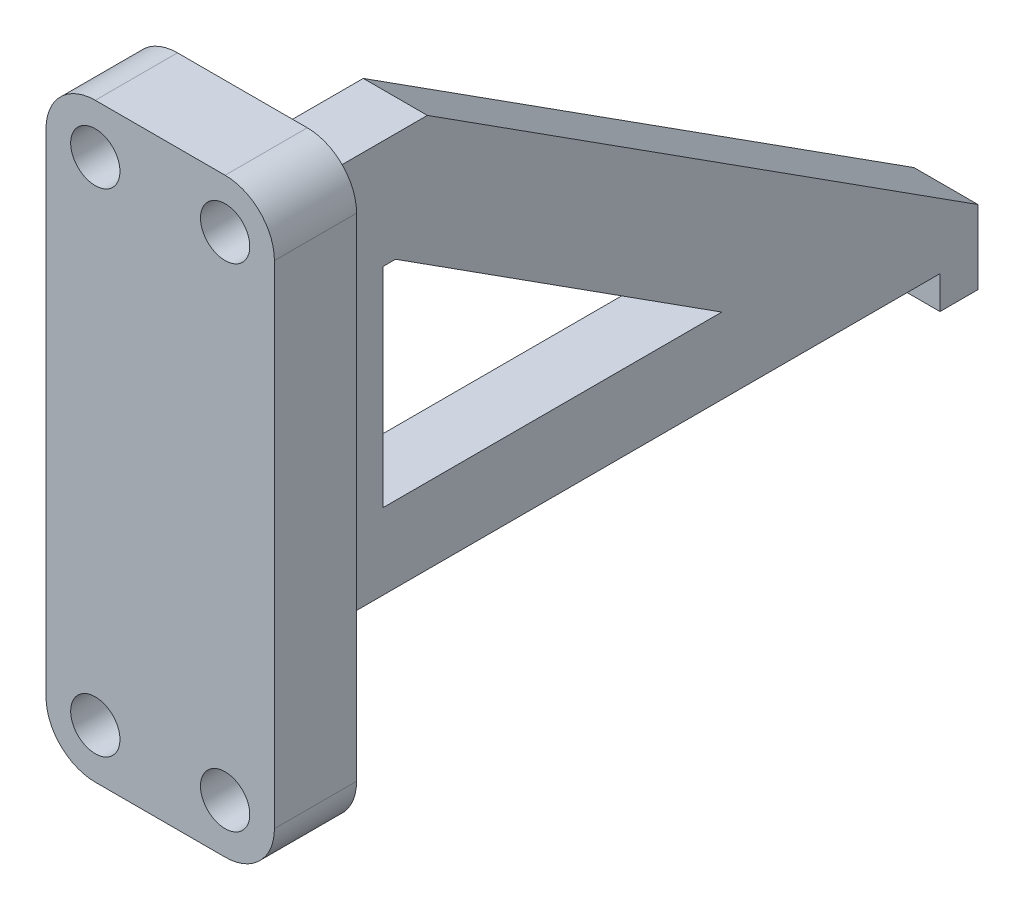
ISO-10303-21;
HEADER;
FILE_DESCRIPTION(('STEP AP214'),'2;1');
FILE_NAME('part.step','',(''),(''),'','','');
FILE_SCHEMA(('AUTOMOTIVE_DESIGN { 1 0 10303 214 1 1 1 1 }'));
ENDSEC;
DATA;
#1=APPLICATION_CONTEXT('core data for automotive mechanical design processes');
#2=APPLICATION_PROTOCOL_DEFINITION('international standard','automotive_design',2000,#1);
#3=PRODUCT_CONTEXT('',#1,'mechanical');
#4=PRODUCT('Part','Part','',(#3));
#5=PRODUCT_RELATED_PRODUCT_CATEGORY('part','',(#4));
#6=PRODUCT_DEFINITION_FORMATION('','',#4);
#7=PRODUCT_DEFINITION_CONTEXT('part definition',#1,'design');
#8=PRODUCT_DEFINITION('design','',#6,#7);
#9=PRODUCT_DEFINITION_SHAPE('','',#8);
#10=(LENGTH_UNIT() NAMED_UNIT(*) SI_UNIT(.MILLI.,.METRE.));
#11=(NAMED_UNIT(*) PLANE_ANGLE_UNIT() SI_UNIT($,.RADIAN.));
#12=(NAMED_UNIT(*) SI_UNIT($,.STERADIAN.) SOLID_ANGLE_UNIT());
#13=UNCERTAINTY_MEASURE_WITH_UNIT(LENGTH_MEASURE(1.E-05),#10,'distance_accuracy_value','');
#14=(GEOMETRIC_REPRESENTATION_CONTEXT(3) GLOBAL_UNCERTAINTY_ASSIGNED_CONTEXT((#13)) GLOBAL_UNIT_ASSIGNED_CONTEXT((#10,
#11,#12)) REPRESENTATION_CONTEXT('',''));
#15=CARTESIAN_POINT('',(0.,0.,0.));
#16=DIRECTION('',(0.,0.,1.));
#17=DIRECTION('',(1.,0.,0.));
#18=AXIS2_PLACEMENT_3D('',#15,#16,#17);
#19=CARTESIAN_POINT('',(7.7978515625,0.,-85.6249419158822));
#20=DIRECTION('',(0.,1.,0.));
#21=DIRECTION('',(0.,0.,1.));
#22=AXIS2_PLACEMENT_3D('',#19,#20,#21);
#23=PLANE('',#22);
#24=DIRECTION('',(0.,0.,-1.));
#25=VECTOR('',#24,1.);
#26=CARTESIAN_POINT('',(7.7978515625,0.,-85.6249419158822));
#27=LINE('',#26,#25);
#28=CARTESIAN_POINT('',(7.7978515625,0.,-81.));
#29=VERTEX_POINT('',#28);
#30=CARTESIAN_POINT('',(7.7978515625,0.,-85.6249419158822));
#31=VERTEX_POINT('',#30);
#32=EDGE_CURVE('E289',#29,#31,#27,.T.);
#33=ORIENTED_EDGE('',*,*,#32,.F.);
#34=DIRECTION('',(-1.,0.,0.));
#35=VECTOR('',#34,1.);
#36=CARTESIAN_POINT('',(7.7978515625,0.,-81.));
#37=LINE('',#36,#35);
#38=CARTESIAN_POINT('',(0.,0.,-81.));
#39=VERTEX_POINT('',#38);
#40=EDGE_CURVE('E202',#29,#39,#37,.T.);
#41=ORIENTED_EDGE('',*,*,#40,.T.);
#42=DIRECTION('',(0.,0.,-1.));
#43=VECTOR('',#42,1.);
#44=CARTESIAN_POINT('',(0.,0.,-85.6249419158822));
#45=LINE('',#44,#43);
#46=CARTESIAN_POINT('',(0.,0.,-85.6249419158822));
#47=VERTEX_POINT('',#46);
#48=EDGE_CURVE('E303',#39,#47,#45,.T.);
#49=ORIENTED_EDGE('',*,*,#48,.T.);
#50=DIRECTION('',(-1.,0.,0.));
#51=VECTOR('',#50,1.);
#52=CARTESIAN_POINT('',(7.7978515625,0.,-85.6249419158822));
#53=LINE('',#52,#51);
#54=EDGE_CURVE('E314',#31,#47,#53,.T.);
#55=ORIENTED_EDGE('',*,*,#54,.F.);
#56=EDGE_LOOP('',(#33,#41,#49,#55));
#57=FACE_BOUND('',#56,.T.);
#58=ADVANCED_FACE('F30',(#57),#23,.F.);
#59=CARTESIAN_POINT('',(7.7978515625,51.8720779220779,0.));
#60=DIRECTION('',(0.,-1.,0.));
#61=DIRECTION('',(0.,0.,-1.));
#62=AXIS2_PLACEMENT_3D('',#59,#60,#61);
#63=PLANE('',#62);
#64=DIRECTION('',(0.,0.,1.));
#65=VECTOR('',#64,1.);
#66=CARTESIAN_POINT('',(0.,51.8720779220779,0.));
#67=LINE('',#66,#65);
#68=CARTESIAN_POINT('',(0.,51.8720779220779,-18.6118250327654));
#69=VERTEX_POINT('',#68);
#70=CARTESIAN_POINT('',(0.,51.8720779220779,0.));
#71=VERTEX_POINT('',#70);
#72=EDGE_CURVE('E273',#69,#71,#67,.T.);
#73=ORIENTED_EDGE('',*,*,#72,.T.);
#74=DIRECTION('',(-1.,0.,0.));
#75=VECTOR('',#74,1.);
#76=CARTESIAN_POINT('',(7.7978515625,51.8720779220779,0.));
#77=LINE('',#76,#75);
#78=CARTESIAN_POINT('',(7.7978515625,51.8720779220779,0.));
#79=VERTEX_POINT('',#78);
#80=EDGE_CURVE('E320',#79,#71,#77,.T.);
#81=ORIENTED_EDGE('',*,*,#80,.F.);
#82=DIRECTION('',(0.,0.,1.));
#83=VECTOR('',#82,1.);
#84=CARTESIAN_POINT('',(7.7978515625,51.8720779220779,0.));
#85=LINE('',#84,#83);
#86=CARTESIAN_POINT('',(7.7978515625,51.8720779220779,-18.6118250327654));
#87=VERTEX_POINT('',#86);
#88=EDGE_CURVE('E284',#87,#79,#85,.T.);
#89=ORIENTED_EDGE('',*,*,#88,.F.);
#90=DIRECTION('',(-1.,0.,0.));
#91=VECTOR('',#90,1.);
#92=CARTESIAN_POINT('',(7.7978515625,51.8720779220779,-18.6118250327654));
#93=LINE('',#92,#91);
#94=EDGE_CURVE('E297',#87,#69,#93,.T.);
#95=ORIENTED_EDGE('',*,*,#94,.T.);
#96=EDGE_LOOP('',(#73,#81,#89,#95));
#97=FACE_BOUND('',#96,.T.);
#98=ADVANCED_FACE('F406',(#97),#63,.F.);
#99=CARTESIAN_POINT('',(0.,0.,0.));
#100=VERTEX_POINT('',#99);
#101=CARTESIAN_POINT('',(0.,0.,-4.00000000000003));
#102=VERTEX_POINT('',#101);
#103=EDGE_CURVE('E304',#100,#102,#45,.T.);
#104=ORIENTED_EDGE('',*,*,#103,.T.);
#105=DIRECTION('',(1.,0.,0.));
#106=VECTOR('',#105,1.);
#107=CARTESIAN_POINT('',(7.7978515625,0.,-4.));
#108=LINE('',#107,#106);
#109=CARTESIAN_POINT('',(7.7978515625,0.,-4.));
#110=VERTEX_POINT('',#109);
#111=EDGE_CURVE('E44',#102,#110,#108,.T.);
#112=ORIENTED_EDGE('',*,*,#111,.T.);
#113=CARTESIAN_POINT('',(7.7978515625,0.,0.));
#114=VERTEX_POINT('',#113);
#115=EDGE_CURVE('E290',#114,#110,#27,.T.);
#116=ORIENTED_EDGE('',*,*,#115,.F.);
#117=DIRECTION('',(-1.,0.,0.));
#118=VECTOR('',#117,1.);
#119=CARTESIAN_POINT('',(7.7978515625,0.,0.));
#120=LINE('',#119,#118);
#121=EDGE_CURVE('E317',#114,#100,#120,.T.);
#122=ORIENTED_EDGE('',*,*,#121,.T.);
#123=EDGE_LOOP('',(#104,#112,#116,#122));
#124=FACE_BOUND('',#123,.T.);
#125=ADVANCED_FACE('F409',(#124),#23,.F.);
#126=CARTESIAN_POINT('',(7.7978515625,8.97246753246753,-85.6249419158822));
#127=DIRECTION('',(0.,0.,1.));
#128=DIRECTION('',(1.,0.,0.));
#129=AXIS2_PLACEMENT_3D('',#126,#127,#128);
#130=PLANE('',#129);
#131=DIRECTION('',(0.,1.,0.));
#132=VECTOR('',#131,1.);
#133=CARTESIAN_POINT('',(0.,8.97246753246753,-85.6249419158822));
#134=LINE('',#133,#132);
#135=CARTESIAN_POINT('',(0.,8.97246753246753,-85.6249419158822));
#136=VERTEX_POINT('',#135);
#137=EDGE_CURVE('E306',#47,#136,#134,.T.);
#138=ORIENTED_EDGE('',*,*,#137,.T.);
#139=DIRECTION('',(-1.,0.,0.));
#140=VECTOR('',#139,1.);
#141=CARTESIAN_POINT('',(7.7978515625,8.97246753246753,-85.6249419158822));
#142=LINE('',#141,#140);
#143=CARTESIAN_POINT('',(7.7978515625,8.97246753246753,-85.6249419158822));
#144=VERTEX_POINT('',#143);
#145=EDGE_CURVE('E311',#144,#136,#142,.T.);
#146=ORIENTED_EDGE('',*,*,#145,.F.);
#147=DIRECTION('',(0.,1.,0.));
#148=VECTOR('',#147,1.);
#149=CARTESIAN_POINT('',(7.7978515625,8.97246753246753,-85.6249419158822));
#150=LINE('',#149,#148);
#151=EDGE_CURVE('E293',#31,#144,#150,.T.);
#152=ORIENTED_EDGE('',*,*,#151,.F.);
#153=ORIENTED_EDGE('',*,*,#54,.T.);
#154=EDGE_LOOP('',(#138,#146,#152,#153));
#155=FACE_BOUND('',#154,.T.);
#156=ADVANCED_FACE('F418',(#155),#130,.F.);
#157=CARTESIAN_POINT('',(7.7978515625,51.8720779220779,-18.6118250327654));
#158=DIRECTION('',(0.,-0.842207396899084,0.539153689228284));
#159=DIRECTION('',(0.,-0.539153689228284,-0.842207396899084));
#160=AXIS2_PLACEMENT_3D('',#157,#158,#159);
#161=PLANE('',#160);
#162=DIRECTION('',(0.,0.539153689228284,0.842207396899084));
#163=VECTOR('',#162,1.);
#164=CARTESIAN_POINT('',(0.,51.8720779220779,-18.6118250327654));
#165=LINE('',#164,#163);
#166=EDGE_CURVE('E287',#136,#69,#165,.T.);
#167=ORIENTED_EDGE('',*,*,#166,.T.);
#168=ORIENTED_EDGE('',*,*,#94,.F.);
#169=DIRECTION('',(0.,0.539153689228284,0.842207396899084));
#170=VECTOR('',#169,1.);
#171=CARTESIAN_POINT('',(7.7978515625,51.8720779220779,-18.6118250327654));
#172=LINE('',#171,#170);
#173=EDGE_CURVE('E295',#144,#87,#172,.T.);
#174=ORIENTED_EDGE('',*,*,#173,.F.);
#175=ORIENTED_EDGE('',*,*,#145,.T.);
#176=EDGE_LOOP('',(#167,#168,#174,#175));
#177=FACE_BOUND('',#176,.T.);
#178=ADVANCED_FACE('F423',(#177),#161,.F.);
#179=CARTESIAN_POINT('',(7.7978515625,51.8720779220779,-85.6249419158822));
#180=DIRECTION('',(-1.,0.,0.));
#181=DIRECTION('',(0.,0.,1.));
#182=AXIS2_PLACEMENT_3D('',#179,#180,#181);
#183=PLANE('',#182);
#184=DIRECTION('',(0.,-0.539153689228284,-0.842207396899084));
#185=VECTOR('',#184,1.);
#186=CARTESIAN_POINT('',(7.7978515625,10.3020198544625,-59.0131474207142));
#187=LINE('',#186,#185);
#188=CARTESIAN_POINT('',(7.7978515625,38.6439895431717,-14.7403973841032));
#189=VERTEX_POINT('',#188);
#190=CARTESIAN_POINT('',(7.7978515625,13.2280883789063,-54.4423606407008));
#191=VERTEX_POINT('',#190);
#192=EDGE_CURVE('E229',#189,#191,#187,.T.);
#193=ORIENTED_EDGE('',*,*,#192,.T.);
#194=DIRECTION('',(0.,0.,1.));
#195=VECTOR('',#194,1.);
#196=CARTESIAN_POINT('',(7.7978515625,13.2280883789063,-85.6249419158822));
#197=LINE('',#196,#195);
#198=CARTESIAN_POINT('',(7.7978515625,13.2280883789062,-13.2280883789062));
#199=VERTEX_POINT('',#198);
#200=EDGE_CURVE('E232',#191,#199,#197,.T.);
#201=ORIENTED_EDGE('',*,*,#200,.T.);
#202=DIRECTION('',(0.,1.,0.));
#203=VECTOR('',#202,1.);
#204=CARTESIAN_POINT('',(7.7978515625,51.8720779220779,-13.2280883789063));
#205=LINE('',#204,#203);
#206=CARTESIAN_POINT('',(7.7978515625,38.6439895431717,-13.2280883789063));
#207=VERTEX_POINT('',#206);
#208=EDGE_CURVE('E218',#199,#207,#205,.T.);
#209=ORIENTED_EDGE('',*,*,#208,.T.);
#210=DIRECTION('',(0.,0.,-1.));
#211=VECTOR('',#210,1.);
#212=CARTESIAN_POINT('',(7.7978515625,38.6439895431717,-85.6249419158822));
#213=LINE('',#212,#211);
#214=EDGE_CURVE('E226',#207,#189,#213,.T.);
#215=ORIENTED_EDGE('',*,*,#214,.T.);
#216=EDGE_LOOP('',(#193,#201,#209,#215));
#217=FACE_BOUND('',#216,.T.);
#218=DIRECTION('',(0.,0.,-1.));
#219=VECTOR('',#218,1.);
#220=CARTESIAN_POINT('',(7.7978515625,4.,-85.6249419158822));
#221=LINE('',#220,#219);
#222=CARTESIAN_POINT('',(7.7978515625,4.,-4.));
#223=VERTEX_POINT('',#222);
#224=CARTESIAN_POINT('',(7.7978515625,4.,-81.));
#225=VERTEX_POINT('',#224);
#226=EDGE_CURVE('E180',#223,#225,#221,.T.);
#227=ORIENTED_EDGE('',*,*,#226,.T.);
#228=DIRECTION('',(0.,-1.,0.));
#229=VECTOR('',#228,1.);
#230=CARTESIAN_POINT('',(7.7978515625,51.8720779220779,-81.));
#231=LINE('',#230,#229);
#232=EDGE_CURVE('E199',#225,#29,#231,.T.);
#233=ORIENTED_EDGE('',*,*,#232,.T.);
#234=ORIENTED_EDGE('',*,*,#32,.T.);
#235=ORIENTED_EDGE('',*,*,#151,.T.);
#236=ORIENTED_EDGE('',*,*,#173,.T.);
#237=ORIENTED_EDGE('',*,*,#88,.T.);
#238=DIRECTION('',(0.,-1.,0.));
#239=VECTOR('',#238,1.);
#240=CARTESIAN_POINT('',(7.7978515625,51.8720779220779,0.));
#241=LINE('',#240,#239);
#242=EDGE_CURVE('E286',#79,#114,#241,.T.);
#243=ORIENTED_EDGE('',*,*,#242,.T.);
#244=ORIENTED_EDGE('',*,*,#115,.T.);
#245=DIRECTION('',(0.,1.,0.));
#246=VECTOR('',#245,1.);
#247=CARTESIAN_POINT('',(7.7978515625,51.8720779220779,-4.));
#248=LINE('',#247,#246);
#249=EDGE_CURVE('E194',#110,#223,#248,.T.);
#250=ORIENTED_EDGE('',*,*,#249,.T.);
#251=EDGE_LOOP('',(#227,#233,#234,#235,#236,#237,#243,#244,#250));
#252=FACE_BOUND('',#251,.T.);
#253=ADVANCED_FACE('F434',(#217,#252),#183,.F.);
#254=CARTESIAN_POINT('',(0.,51.8720779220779,-85.6249419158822));
#255=DIRECTION('',(-1.,0.,0.));
#256=DIRECTION('',(0.,0.,1.));
#257=AXIS2_PLACEMENT_3D('',#254,#255,#256);
#258=PLANE('',#257);
#259=DIRECTION('',(0.,-1.,0.));
#260=VECTOR('',#259,1.);
#261=CARTESIAN_POINT('',(0.,4.,-81.));
#262=LINE('',#261,#260);
#263=CARTESIAN_POINT('',(0.,4.,-81.));
#264=VERTEX_POINT('',#263);
#265=EDGE_CURVE('E190',#264,#39,#262,.T.);
#266=ORIENTED_EDGE('',*,*,#265,.F.);
#267=DIRECTION('',(0.,0.,-1.));
#268=VECTOR('',#267,1.);
#269=CARTESIAN_POINT('',(0.,4.,-81.));
#270=LINE('',#269,#268);
#271=CARTESIAN_POINT('',(0.,4.,-4.));
#272=VERTEX_POINT('',#271);
#273=EDGE_CURVE('E177',#272,#264,#270,.T.);
#274=ORIENTED_EDGE('',*,*,#273,.F.);
#275=DIRECTION('',(0.,1.,0.));
#276=VECTOR('',#275,1.);
#277=CARTESIAN_POINT('',(0.,51.8720779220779,-4.));
#278=LINE('',#277,#276);
#279=EDGE_CURVE('E11',#102,#272,#278,.T.);
#280=ORIENTED_EDGE('',*,*,#279,.F.);
#281=ORIENTED_EDGE('',*,*,#103,.F.);
#282=DIRECTION('',(0.,-1.,0.));
#283=VECTOR('',#282,1.);
#284=CARTESIAN_POINT('',(0.,51.8720779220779,0.));
#285=LINE('',#284,#283);
#286=EDGE_CURVE('E300',#71,#100,#285,.T.);
#287=ORIENTED_EDGE('',*,*,#286,.F.);
#288=ORIENTED_EDGE('',*,*,#72,.F.);
#289=ORIENTED_EDGE('',*,*,#166,.F.);
#290=ORIENTED_EDGE('',*,*,#137,.F.);
#291=ORIENTED_EDGE('',*,*,#48,.F.);
#292=EDGE_LOOP('',(#266,#274,#280,#281,#287,#288,#289,#290,#291));
#293=FACE_BOUND('',#292,.T.);
#294=DIRECTION('',(0.,0.,1.));
#295=VECTOR('',#294,1.);
#296=CARTESIAN_POINT('',(0.,13.2280883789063,-54.4423606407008));
#297=LINE('',#296,#295);
#298=CARTESIAN_POINT('',(0.,13.2280883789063,-54.4423606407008));
#299=VERTEX_POINT('',#298);
#300=CARTESIAN_POINT('',(0.,13.2280883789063,-13.2280883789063));
#301=VERTEX_POINT('',#300);
#302=EDGE_CURVE('E205',#299,#301,#297,.T.);
#303=ORIENTED_EDGE('',*,*,#302,.F.);
#304=DIRECTION('',(0.,-0.539153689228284,-0.842207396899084));
#305=VECTOR('',#304,1.);
#306=CARTESIAN_POINT('',(0.,38.6439895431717,-14.7403973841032));
#307=LINE('',#306,#305);
#308=CARTESIAN_POINT('',(0.,38.6439895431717,-14.7403973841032));
#309=VERTEX_POINT('',#308);
#310=EDGE_CURVE('E212',#309,#299,#307,.T.);
#311=ORIENTED_EDGE('',*,*,#310,.F.);
#312=DIRECTION('',(0.,0.,-1.));
#313=VECTOR('',#312,1.);
#314=CARTESIAN_POINT('',(0.,38.6439895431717,-13.2280883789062));
#315=LINE('',#314,#313);
#316=CARTESIAN_POINT('',(0.,38.6439895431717,-13.2280883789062));
#317=VERTEX_POINT('',#316);
#318=EDGE_CURVE('E209',#317,#309,#315,.T.);
#319=ORIENTED_EDGE('',*,*,#318,.F.);
#320=DIRECTION('',(0.,1.,0.));
#321=VECTOR('',#320,1.);
#322=CARTESIAN_POINT('',(0.,13.2280883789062,-13.2280883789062));
#323=LINE('',#322,#321);
#324=EDGE_CURVE('E207',#301,#317,#323,.T.);
#325=ORIENTED_EDGE('',*,*,#324,.F.);
#326=EDGE_LOOP('',(#303,#311,#319,#325));
#327=FACE_BOUND('',#326,.T.);
#328=ADVANCED_FACE('F187',(#293,#327),#258,.T.);
#329=CARTESIAN_POINT('',(-10.,61.8720779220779,0.));
#330=DIRECTION('',(0.,0.,1.));
#331=DIRECTION('',(1.,0.,0.));
#332=AXIS2_PLACEMENT_3D('',#329,#330,#331);
#333=PLANE('',#332);
#334=CARTESIAN_POINT('',(-4.,-4.,0.));
#335=DIRECTION('',(0.,0.,-1.));
#336=DIRECTION('',(-1.,0.,0.));
#337=AXIS2_PLACEMENT_3D('',#334,#335,#336);
#338=CIRCLE('',#337,3.);
#339=CARTESIAN_POINT('',(-7.,-4.,0.));
#340=VERTEX_POINT('',#339);
#341=EDGE_CURVE('E235',#340,#340,#338,.T.);
#342=ORIENTED_EDGE('',*,*,#341,.F.);
#343=EDGE_LOOP('',(#342));
#344=FACE_BOUND('',#343,.T.);
#345=CARTESIAN_POINT('',(11.7978515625,-4.,0.));
#346=DIRECTION('',(0.,0.,-1.));
#347=DIRECTION('',(-1.,0.,0.));
#348=AXIS2_PLACEMENT_3D('',#345,#346,#347);
#349=CIRCLE('',#348,3.);
#350=CARTESIAN_POINT('',(8.7978515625,-4.,0.));
#351=VERTEX_POINT('',#350);
#352=EDGE_CURVE('E239',#351,#351,#349,.T.);
#353=ORIENTED_EDGE('',*,*,#352,.F.);
#354=EDGE_LOOP('',(#353));
#355=FACE_BOUND('',#354,.T.);
#356=CARTESIAN_POINT('',(-4.,55.8720779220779,0.));
#357=DIRECTION('',(0.,0.,-1.));
#358=DIRECTION('',(-1.,0.,0.));
#359=AXIS2_PLACEMENT_3D('',#356,#357,#358);
#360=CIRCLE('',#359,3.);
#361=CARTESIAN_POINT('',(-7.,55.8720779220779,0.));
#362=VERTEX_POINT('',#361);
#363=EDGE_CURVE('E245',#362,#362,#360,.T.);
#364=ORIENTED_EDGE('',*,*,#363,.F.);
#365=EDGE_LOOP('',(#364));
#366=FACE_BOUND('',#365,.T.);
#367=CARTESIAN_POINT('',(11.7978515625,55.8720779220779,0.));
#368=DIRECTION('',(0.,0.,-1.));
#369=DIRECTION('',(-1.,0.,0.));
#370=AXIS2_PLACEMENT_3D('',#367,#368,#369);
#371=CIRCLE('',#370,3.);
#372=CARTESIAN_POINT('',(8.7978515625,55.8720779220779,0.));
#373=VERTEX_POINT('',#372);
#374=EDGE_CURVE('E251',#373,#373,#371,.T.);
#375=ORIENTED_EDGE('',*,*,#374,.F.);
#376=EDGE_LOOP('',(#375));
#377=FACE_BOUND('',#376,.T.);
#378=DIRECTION('',(-1.,0.,0.));
#379=VECTOR('',#378,1.);
#380=CARTESIAN_POINT('',(17.7978515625,61.8720779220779,0.));
#381=LINE('',#380,#379);
#382=CARTESIAN_POINT('',(11.7978515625,61.8720779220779,0.));
#383=VERTEX_POINT('',#382);
#384=CARTESIAN_POINT('',(-4.,61.8720779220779,0.));
#385=VERTEX_POINT('',#384);
#386=EDGE_CURVE('E257',#383,#385,#381,.T.);
#387=ORIENTED_EDGE('',*,*,#386,.F.);
#388=CARTESIAN_POINT('',(11.7978515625,55.8720779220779,0.));
#389=DIRECTION('',(0.,0.,1.));
#390=DIRECTION('',(1.,0.,0.));
#391=AXIS2_PLACEMENT_3D('',#388,#389,#390);
#392=CIRCLE('',#391,6.);
#393=CARTESIAN_POINT('',(17.7978515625,55.8720779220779,0.));
#394=VERTEX_POINT('',#393);
#395=EDGE_CURVE('E334',#383,#394,#392,.F.);
#396=ORIENTED_EDGE('',*,*,#395,.T.);
#397=DIRECTION('',(0.,1.,0.));
#398=VECTOR('',#397,1.);
#399=CARTESIAN_POINT('',(17.7978515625,-10.,0.));
#400=LINE('',#399,#398);
#401=CARTESIAN_POINT('',(17.7978515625,-4.,0.));
#402=VERTEX_POINT('',#401);
#403=EDGE_CURVE('E264',#402,#394,#400,.T.);
#404=ORIENTED_EDGE('',*,*,#403,.F.);
#405=CARTESIAN_POINT('',(11.7978515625,-4.,0.));
#406=DIRECTION('',(0.,0.,1.));
#407=DIRECTION('',(1.,0.,0.));
#408=AXIS2_PLACEMENT_3D('',#405,#406,#407);
#409=CIRCLE('',#408,6.);
#410=CARTESIAN_POINT('',(11.7978515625,-10.,0.));
#411=VERTEX_POINT('',#410);
#412=EDGE_CURVE('E330',#402,#411,#409,.F.);
#413=ORIENTED_EDGE('',*,*,#412,.T.);
#414=DIRECTION('',(1.,0.,0.));
#415=VECTOR('',#414,1.);
#416=CARTESIAN_POINT('',(-10.,-10.,0.));
#417=LINE('',#416,#415);
#418=CARTESIAN_POINT('',(-4.,-10.,0.));
#419=VERTEX_POINT('',#418);
#420=EDGE_CURVE('E279',#419,#411,#417,.T.);
#421=ORIENTED_EDGE('',*,*,#420,.F.);
#422=CARTESIAN_POINT('',(-4.,-4.,0.));
#423=DIRECTION('',(0.,0.,1.));
#424=DIRECTION('',(1.,0.,0.));
#425=AXIS2_PLACEMENT_3D('',#422,#423,#424);
#426=CIRCLE('',#425,6.);
#427=CARTESIAN_POINT('',(-10.,-4.,0.));
#428=VERTEX_POINT('',#427);
#429=EDGE_CURVE('E328',#419,#428,#426,.F.);
#430=ORIENTED_EDGE('',*,*,#429,.T.);
#431=DIRECTION('',(0.,-1.,0.));
#432=VECTOR('',#431,1.);
#433=CARTESIAN_POINT('',(-10.,61.8720779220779,0.));
#434=LINE('',#433,#432);
#435=CARTESIAN_POINT('',(-10.,55.8720779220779,0.));
#436=VERTEX_POINT('',#435);
#437=EDGE_CURVE('E276',#436,#428,#434,.T.);
#438=ORIENTED_EDGE('',*,*,#437,.F.);
#439=CARTESIAN_POINT('',(-4.,55.8720779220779,0.));
#440=DIRECTION('',(0.,0.,1.));
#441=DIRECTION('',(1.,0.,0.));
#442=AXIS2_PLACEMENT_3D('',#439,#440,#441);
#443=CIRCLE('',#442,6.);
#444=EDGE_CURVE('E332',#436,#385,#443,.F.);
#445=ORIENTED_EDGE('',*,*,#444,.T.);
#446=EDGE_LOOP('',(#387,#396,#404,#413,#421,#430,#438,#445));
#447=FACE_BOUND('',#446,.T.);
#448=ORIENTED_EDGE('',*,*,#121,.F.);
#449=ORIENTED_EDGE('',*,*,#242,.F.);
#450=ORIENTED_EDGE('',*,*,#80,.T.);
#451=ORIENTED_EDGE('',*,*,#286,.T.);
#452=EDGE_LOOP('',(#448,#449,#450,#451));
#453=FACE_BOUND('',#452,.T.);
#454=ADVANCED_FACE('F376',(#344,#355,#366,#377,#447,#453),#333,.F.);
#455=CARTESIAN_POINT('',(17.7978515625,61.8720779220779,10.));
#456=DIRECTION('',(0.,-1.,0.));
#457=DIRECTION('',(0.,0.,-1.));
#458=AXIS2_PLACEMENT_3D('',#455,#456,#457);
#459=PLANE('',#458);
#460=DIRECTION('',(-1.,0.,0.));
#461=VECTOR('',#460,1.);
#462=CARTESIAN_POINT('',(17.7978515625,61.8720779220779,10.));
#463=LINE('',#462,#461);
#464=CARTESIAN_POINT('',(11.7978515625,61.8720779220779,10.));
#465=VERTEX_POINT('',#464);
#466=CARTESIAN_POINT('',(-4.,61.8720779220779,10.));
#467=VERTEX_POINT('',#466);
#468=EDGE_CURVE('E260',#465,#467,#463,.T.);
#469=ORIENTED_EDGE('',*,*,#468,.F.);
#470=DIRECTION('',(0.,0.,-1.));
#471=VECTOR('',#470,1.);
#472=CARTESIAN_POINT('',(11.7978515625,61.8720779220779,10.));
#473=LINE('',#472,#471);
#474=EDGE_CURVE('E325',#465,#383,#473,.T.);
#475=ORIENTED_EDGE('',*,*,#474,.T.);
#476=ORIENTED_EDGE('',*,*,#386,.T.);
#477=DIRECTION('',(0.,0.,-1.));
#478=VECTOR('',#477,1.);
#479=CARTESIAN_POINT('',(-4.,61.8720779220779,10.));
#480=LINE('',#479,#478);
#481=EDGE_CURVE('E323',#385,#467,#480,.F.);
#482=ORIENTED_EDGE('',*,*,#481,.T.);
#483=EDGE_LOOP('',(#469,#475,#476,#482));
#484=FACE_BOUND('',#483,.T.);
#485=ADVANCED_FACE('F384',(#484),#459,.F.);
#486=CARTESIAN_POINT('',(-10.,61.8720779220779,10.));
#487=DIRECTION('',(1.,0.,0.));
#488=DIRECTION('',(0.,0.,-1.));
#489=AXIS2_PLACEMENT_3D('',#486,#487,#488);
#490=PLANE('',#489);
#491=DIRECTION('',(0.,-1.,0.));
#492=VECTOR('',#491,1.);
#493=CARTESIAN_POINT('',(-10.,61.8720779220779,10.));
#494=LINE('',#493,#492);
#495=CARTESIAN_POINT('',(-10.,55.8720779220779,10.));
#496=VERTEX_POINT('',#495);
#497=CARTESIAN_POINT('',(-10.,-4.,10.));
#498=VERTEX_POINT('',#497);
#499=EDGE_CURVE('E263',#496,#498,#494,.T.);
#500=ORIENTED_EDGE('',*,*,#499,.F.);
#501=DIRECTION('',(0.,0.,-1.));
#502=VECTOR('',#501,1.);
#503=CARTESIAN_POINT('',(-10.,55.8720779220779,10.));
#504=LINE('',#503,#502);
#505=EDGE_CURVE('E351',#496,#436,#504,.T.);
#506=ORIENTED_EDGE('',*,*,#505,.T.);
#507=ORIENTED_EDGE('',*,*,#437,.T.);
#508=DIRECTION('',(0.,0.,-1.));
#509=VECTOR('',#508,1.);
#510=CARTESIAN_POINT('',(-10.,-4.,10.));
#511=LINE('',#510,#509);
#512=EDGE_CURVE('E349',#428,#498,#511,.F.);
#513=ORIENTED_EDGE('',*,*,#512,.T.);
#514=EDGE_LOOP('',(#500,#506,#507,#513));
#515=FACE_BOUND('',#514,.T.);
#516=ADVANCED_FACE('F393',(#515),#490,.F.);
#517=CARTESIAN_POINT('',(-10.,-10.,10.));
#518=DIRECTION('',(0.,1.,0.));
#519=DIRECTION('',(0.,0.,1.));
#520=AXIS2_PLACEMENT_3D('',#517,#518,#519);
#521=PLANE('',#520);
#522=ORIENTED_EDGE('',*,*,#420,.T.);
#523=DIRECTION('',(0.,0.,-1.));
#524=VECTOR('',#523,1.);
#525=CARTESIAN_POINT('',(11.7978515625,-10.,10.));
#526=LINE('',#525,#524);
#527=CARTESIAN_POINT('',(11.7978515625,-10.,10.));
#528=VERTEX_POINT('',#527);
#529=EDGE_CURVE('E38',#411,#528,#526,.F.);
#530=ORIENTED_EDGE('',*,*,#529,.T.);
#531=DIRECTION('',(1.,0.,0.));
#532=VECTOR('',#531,1.);
#533=CARTESIAN_POINT('',(-10.,-10.,10.));
#534=LINE('',#533,#532);
#535=CARTESIAN_POINT('',(-4.,-10.,10.));
#536=VERTEX_POINT('',#535);
#537=EDGE_CURVE('E267',#536,#528,#534,.T.);
#538=ORIENTED_EDGE('',*,*,#537,.F.);
#539=DIRECTION('',(0.,0.,-1.));
#540=VECTOR('',#539,1.);
#541=CARTESIAN_POINT('',(-4.,-10.,10.));
#542=LINE('',#541,#540);
#543=EDGE_CURVE('E354',#536,#419,#542,.T.);
#544=ORIENTED_EDGE('',*,*,#543,.T.);
#545=EDGE_LOOP('',(#522,#530,#538,#544));
#546=FACE_BOUND('',#545,.T.);
#547=ADVANCED_FACE('F359',(#546),#521,.F.);
#548=CARTESIAN_POINT('',(17.7978515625,-10.,10.));
#549=DIRECTION('',(-1.,0.,0.));
#550=DIRECTION('',(0.,0.,1.));
#551=AXIS2_PLACEMENT_3D('',#548,#549,#550);
#552=PLANE('',#551);
#553=ORIENTED_EDGE('',*,*,#403,.T.);
#554=DIRECTION('',(0.,0.,-1.));
#555=VECTOR('',#554,1.);
#556=CARTESIAN_POINT('',(17.7978515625,55.8720779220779,10.));
#557=LINE('',#556,#555);
#558=CARTESIAN_POINT('',(17.7978515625,55.8720779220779,10.));
#559=VERTEX_POINT('',#558);
#560=EDGE_CURVE('E339',#394,#559,#557,.F.);
#561=ORIENTED_EDGE('',*,*,#560,.T.);
#562=DIRECTION('',(0.,1.,0.));
#563=VECTOR('',#562,1.);
#564=CARTESIAN_POINT('',(17.7978515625,-10.,10.));
#565=LINE('',#564,#563);
#566=CARTESIAN_POINT('',(17.7978515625,-4.,10.));
#567=VERTEX_POINT('',#566);
#568=EDGE_CURVE('E270',#567,#559,#565,.T.);
#569=ORIENTED_EDGE('',*,*,#568,.F.);
#570=DIRECTION('',(0.,0.,-1.));
#571=VECTOR('',#570,1.);
#572=CARTESIAN_POINT('',(17.7978515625,-4.,10.));
#573=LINE('',#572,#571);
#574=EDGE_CURVE('E336',#567,#402,#573,.T.);
#575=ORIENTED_EDGE('',*,*,#574,.T.);
#576=EDGE_LOOP('',(#553,#561,#569,#575));
#577=FACE_BOUND('',#576,.T.);
#578=ADVANCED_FACE('F372',(#577),#552,.F.);
#579=CARTESIAN_POINT('',(-10.,61.8720779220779,10.));
#580=DIRECTION('',(0.,0.,1.));
#581=DIRECTION('',(1.,0.,0.));
#582=AXIS2_PLACEMENT_3D('',#579,#580,#581);
#583=PLANE('',#582);
#584=CARTESIAN_POINT('',(-4.,-4.,10.));
#585=DIRECTION('',(0.,0.,-1.));
#586=DIRECTION('',(-1.,0.,0.));
#587=AXIS2_PLACEMENT_3D('',#584,#585,#586);
#588=CIRCLE('',#587,3.);
#589=CARTESIAN_POINT('',(-7.,-4.,10.));
#590=VERTEX_POINT('',#589);
#591=EDGE_CURVE('E236',#590,#590,#588,.T.);
#592=ORIENTED_EDGE('',*,*,#591,.T.);
#593=EDGE_LOOP('',(#592));
#594=FACE_BOUND('',#593,.T.);
#595=CARTESIAN_POINT('',(11.7978515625,-4.,10.));
#596=DIRECTION('',(0.,0.,-1.));
#597=DIRECTION('',(-1.,0.,0.));
#598=AXIS2_PLACEMENT_3D('',#595,#596,#597);
#599=CIRCLE('',#598,3.);
#600=CARTESIAN_POINT('',(8.7978515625,-4.,10.));
#601=VERTEX_POINT('',#600);
#602=EDGE_CURVE('E242',#601,#601,#599,.T.);
#603=ORIENTED_EDGE('',*,*,#602,.T.);
#604=EDGE_LOOP('',(#603));
#605=FACE_BOUND('',#604,.T.);
#606=CARTESIAN_POINT('',(-4.,55.8720779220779,10.));
#607=DIRECTION('',(0.,0.,-1.));
#608=DIRECTION('',(-1.,0.,0.));
#609=AXIS2_PLACEMENT_3D('',#606,#607,#608);
#610=CIRCLE('',#609,3.);
#611=CARTESIAN_POINT('',(-7.,55.8720779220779,10.));
#612=VERTEX_POINT('',#611);
#613=EDGE_CURVE('E248',#612,#612,#610,.T.);
#614=ORIENTED_EDGE('',*,*,#613,.T.);
#615=EDGE_LOOP('',(#614));
#616=FACE_BOUND('',#615,.T.);
#617=CARTESIAN_POINT('',(11.7978515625,55.8720779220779,10.));
#618=DIRECTION('',(0.,0.,-1.));
#619=DIRECTION('',(-1.,0.,0.));
#620=AXIS2_PLACEMENT_3D('',#617,#618,#619);
#621=CIRCLE('',#620,3.);
#622=CARTESIAN_POINT('',(8.7978515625,55.8720779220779,10.));
#623=VERTEX_POINT('',#622);
#624=EDGE_CURVE('E254',#623,#623,#621,.T.);
#625=ORIENTED_EDGE('',*,*,#624,.T.);
#626=EDGE_LOOP('',(#625));
#627=FACE_BOUND('',#626,.T.);
#628=ORIENTED_EDGE('',*,*,#568,.T.);
#629=CARTESIAN_POINT('',(11.7978515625,55.8720779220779,10.));
#630=DIRECTION('',(0.,0.,1.));
#631=DIRECTION('',(1.,0.,0.));
#632=AXIS2_PLACEMENT_3D('',#629,#630,#631);
#633=CIRCLE('',#632,6.);
#634=EDGE_CURVE('E347',#559,#465,#633,.T.);
#635=ORIENTED_EDGE('',*,*,#634,.T.);
#636=ORIENTED_EDGE('',*,*,#468,.T.);
#637=CARTESIAN_POINT('',(-4.,55.8720779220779,10.));
#638=DIRECTION('',(0.,0.,1.));
#639=DIRECTION('',(1.,0.,0.));
#640=AXIS2_PLACEMENT_3D('',#637,#638,#639);
#641=CIRCLE('',#640,6.);
#642=EDGE_CURVE('E345',#467,#496,#641,.T.);
#643=ORIENTED_EDGE('',*,*,#642,.T.);
#644=ORIENTED_EDGE('',*,*,#499,.T.);
#645=CARTESIAN_POINT('',(-4.,-4.,10.));
#646=DIRECTION('',(0.,0.,1.));
#647=DIRECTION('',(1.,0.,0.));
#648=AXIS2_PLACEMENT_3D('',#645,#646,#647);
#649=CIRCLE('',#648,6.);
#650=EDGE_CURVE('E341',#498,#536,#649,.T.);
#651=ORIENTED_EDGE('',*,*,#650,.T.);
#652=ORIENTED_EDGE('',*,*,#537,.T.);
#653=CARTESIAN_POINT('',(11.7978515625,-4.,10.));
#654=DIRECTION('',(0.,0.,1.));
#655=DIRECTION('',(1.,0.,0.));
#656=AXIS2_PLACEMENT_3D('',#653,#654,#655);
#657=CIRCLE('',#656,6.);
#658=EDGE_CURVE('E343',#528,#567,#657,.T.);
#659=ORIENTED_EDGE('',*,*,#658,.T.);
#660=EDGE_LOOP('',(#628,#635,#636,#643,#644,#651,#652,#659));
#661=FACE_BOUND('',#660,.T.);
#662=ADVANCED_FACE('F365',(#594,#605,#616,#627,#661),#583,.T.);
#663=CARTESIAN_POINT('',(11.7978515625,55.8720779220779,10.));
#664=DIRECTION('',(0.,0.,-1.));
#665=DIRECTION('',(-1.,0.,0.));
#666=AXIS2_PLACEMENT_3D('',#663,#664,#665);
#667=CYLINDRICAL_SURFACE('',#666,3.);
#668=ORIENTED_EDGE('',*,*,#624,.F.);
#669=EDGE_LOOP('',(#668));
#670=FACE_BOUND('',#669,.T.);
#671=ORIENTED_EDGE('',*,*,#374,.T.);
#672=EDGE_LOOP('',(#671));
#673=FACE_BOUND('',#672,.T.);
#674=ADVANCED_FACE('F472',(#670,#673),#667,.F.);
#675=CARTESIAN_POINT('',(-4.,55.8720779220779,10.));
#676=DIRECTION('',(0.,0.,-1.));
#677=DIRECTION('',(-1.,0.,0.));
#678=AXIS2_PLACEMENT_3D('',#675,#676,#677);
#679=CYLINDRICAL_SURFACE('',#678,3.);
#680=ORIENTED_EDGE('',*,*,#613,.F.);
#681=EDGE_LOOP('',(#680));
#682=FACE_BOUND('',#681,.T.);
#683=ORIENTED_EDGE('',*,*,#363,.T.);
#684=EDGE_LOOP('',(#683));
#685=FACE_BOUND('',#684,.T.);
#686=ADVANCED_FACE('F468',(#682,#685),#679,.F.);
#687=CARTESIAN_POINT('',(11.7978515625,-4.,10.));
#688=DIRECTION('',(0.,0.,-1.));
#689=DIRECTION('',(-1.,0.,0.));
#690=AXIS2_PLACEMENT_3D('',#687,#688,#689);
#691=CYLINDRICAL_SURFACE('',#690,3.);
#692=ORIENTED_EDGE('',*,*,#602,.F.);
#693=EDGE_LOOP('',(#692));
#694=FACE_BOUND('',#693,.T.);
#695=ORIENTED_EDGE('',*,*,#352,.T.);
#696=EDGE_LOOP('',(#695));
#697=FACE_BOUND('',#696,.T.);
#698=ADVANCED_FACE('F464',(#694,#697),#691,.F.);
#699=CARTESIAN_POINT('',(-4.,-4.,10.));
#700=DIRECTION('',(0.,0.,-1.));
#701=DIRECTION('',(-1.,0.,0.));
#702=AXIS2_PLACEMENT_3D('',#699,#700,#701);
#703=CYLINDRICAL_SURFACE('',#702,3.);
#704=ORIENTED_EDGE('',*,*,#591,.F.);
#705=EDGE_LOOP('',(#704));
#706=FACE_BOUND('',#705,.T.);
#707=ORIENTED_EDGE('',*,*,#341,.T.);
#708=EDGE_LOOP('',(#707));
#709=FACE_BOUND('',#708,.T.);
#710=ADVANCED_FACE('F461',(#706,#709),#703,.F.);
#711=CARTESIAN_POINT('',(11.7978515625,55.8720779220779,10.));
#712=DIRECTION('',(0.,0.,-1.));
#713=DIRECTION('',(-1.,0.,0.));
#714=AXIS2_PLACEMENT_3D('',#711,#712,#713);
#715=CYLINDRICAL_SURFACE('',#714,6.);
#716=ORIENTED_EDGE('',*,*,#634,.F.);
#717=ORIENTED_EDGE('',*,*,#560,.F.);
#718=ORIENTED_EDGE('',*,*,#395,.F.);
#719=ORIENTED_EDGE('',*,*,#474,.F.);
#720=EDGE_LOOP('',(#716,#717,#718,#719));
#721=FACE_BOUND('',#720,.T.);
#722=ADVANCED_FACE('F381',(#721),#715,.T.);
#723=CARTESIAN_POINT('',(-4.,55.8720779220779,10.));
#724=DIRECTION('',(0.,0.,-1.));
#725=DIRECTION('',(-1.,0.,0.));
#726=AXIS2_PLACEMENT_3D('',#723,#724,#725);
#727=CYLINDRICAL_SURFACE('',#726,6.);
#728=ORIENTED_EDGE('',*,*,#642,.F.);
#729=ORIENTED_EDGE('',*,*,#481,.F.);
#730=ORIENTED_EDGE('',*,*,#444,.F.);
#731=ORIENTED_EDGE('',*,*,#505,.F.);
#732=EDGE_LOOP('',(#728,#729,#730,#731));
#733=FACE_BOUND('',#732,.T.);
#734=ADVANCED_FACE('F390',(#733),#727,.T.);
#735=CARTESIAN_POINT('',(11.7978515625,-4.,10.));
#736=DIRECTION('',(0.,0.,-1.));
#737=DIRECTION('',(-1.,0.,0.));
#738=AXIS2_PLACEMENT_3D('',#735,#736,#737);
#739=CYLINDRICAL_SURFACE('',#738,6.);
#740=ORIENTED_EDGE('',*,*,#658,.F.);
#741=ORIENTED_EDGE('',*,*,#529,.F.);
#742=ORIENTED_EDGE('',*,*,#412,.F.);
#743=ORIENTED_EDGE('',*,*,#574,.F.);
#744=EDGE_LOOP('',(#740,#741,#742,#743));
#745=FACE_BOUND('',#744,.T.);
#746=ADVANCED_FACE('F369',(#745),#739,.T.);
#747=CARTESIAN_POINT('',(-4.,-4.,10.));
#748=DIRECTION('',(0.,0.,-1.));
#749=DIRECTION('',(-1.,0.,0.));
#750=AXIS2_PLACEMENT_3D('',#747,#748,#749);
#751=CYLINDRICAL_SURFACE('',#750,6.);
#752=ORIENTED_EDGE('',*,*,#650,.F.);
#753=ORIENTED_EDGE('',*,*,#512,.F.);
#754=ORIENTED_EDGE('',*,*,#429,.F.);
#755=ORIENTED_EDGE('',*,*,#543,.F.);
#756=EDGE_LOOP('',(#752,#753,#754,#755));
#757=FACE_BOUND('',#756,.T.);
#758=ADVANCED_FACE('F32',(#757),#751,.T.);
#759=CARTESIAN_POINT('',(10.,13.2280883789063,-54.4423606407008));
#760=DIRECTION('',(0.,-1.,0.));
#761=DIRECTION('',(0.,0.,-1.));
#762=AXIS2_PLACEMENT_3D('',#759,#760,#761);
#763=PLANE('',#762);
#764=DIRECTION('',(-1.,0.,0.));
#765=VECTOR('',#764,1.);
#766=CARTESIAN_POINT('',(10.,13.2280883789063,-54.4423606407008));
#767=LINE('',#766,#765);
#768=EDGE_CURVE('E216',#191,#299,#767,.T.);
#769=ORIENTED_EDGE('',*,*,#768,.T.);
#770=ORIENTED_EDGE('',*,*,#302,.T.);
#771=DIRECTION('',(-1.,0.,0.));
#772=VECTOR('',#771,1.);
#773=CARTESIAN_POINT('',(10.,13.2280883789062,-13.2280883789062));
#774=LINE('',#773,#772);
#775=EDGE_CURVE('E215',#199,#301,#774,.T.);
#776=ORIENTED_EDGE('',*,*,#775,.F.);
#777=ORIENTED_EDGE('',*,*,#200,.F.);
#778=EDGE_LOOP('',(#769,#770,#776,#777));
#779=FACE_BOUND('',#778,.T.);
#780=ADVANCED_FACE('F397',(#779),#763,.F.);
#781=CARTESIAN_POINT('',(10.,38.6439895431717,-14.7403973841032));
#782=DIRECTION('',(0.,0.842207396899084,-0.539153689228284));
#783=DIRECTION('',(0.,0.539153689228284,0.842207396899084));
#784=AXIS2_PLACEMENT_3D('',#781,#782,#783);
#785=PLANE('',#784);
#786=DIRECTION('',(-1.,0.,0.));
#787=VECTOR('',#786,1.);
#788=CARTESIAN_POINT('',(10.,38.6439895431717,-14.7403973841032));
#789=LINE('',#788,#787);
#790=EDGE_CURVE('E219',#189,#309,#789,.T.);
#791=ORIENTED_EDGE('',*,*,#790,.T.);
#792=ORIENTED_EDGE('',*,*,#310,.T.);
#793=ORIENTED_EDGE('',*,*,#768,.F.);
#794=ORIENTED_EDGE('',*,*,#192,.F.);
#795=EDGE_LOOP('',(#791,#792,#793,#794));
#796=FACE_BOUND('',#795,.T.);
#797=ADVANCED_FACE('F402',(#796),#785,.F.);
#798=CARTESIAN_POINT('',(10.,38.6439895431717,-13.2280883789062));
#799=DIRECTION('',(0.,1.,0.));
#800=DIRECTION('',(0.,0.,1.));
#801=AXIS2_PLACEMENT_3D('',#798,#799,#800);
#802=PLANE('',#801);
#803=DIRECTION('',(-1.,0.,0.));
#804=VECTOR('',#803,1.);
#805=CARTESIAN_POINT('',(10.,38.6439895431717,-13.2280883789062));
#806=LINE('',#805,#804);
#807=EDGE_CURVE('E52',#207,#317,#806,.T.);
#808=ORIENTED_EDGE('',*,*,#807,.T.);
#809=ORIENTED_EDGE('',*,*,#318,.T.);
#810=ORIENTED_EDGE('',*,*,#790,.F.);
#811=ORIENTED_EDGE('',*,*,#214,.F.);
#812=EDGE_LOOP('',(#808,#809,#810,#811));
#813=FACE_BOUND('',#812,.T.);
#814=ADVANCED_FACE('F451',(#813),#802,.F.);
#815=CARTESIAN_POINT('',(10.,13.2280883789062,-13.2280883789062));
#816=DIRECTION('',(0.,0.,1.));
#817=DIRECTION('',(1.,0.,0.));
#818=AXIS2_PLACEMENT_3D('',#815,#816,#817);
#819=PLANE('',#818);
#820=ORIENTED_EDGE('',*,*,#775,.T.);
#821=ORIENTED_EDGE('',*,*,#324,.T.);
#822=ORIENTED_EDGE('',*,*,#807,.F.);
#823=ORIENTED_EDGE('',*,*,#208,.F.);
#824=EDGE_LOOP('',(#820,#821,#822,#823));
#825=FACE_BOUND('',#824,.T.);
#826=ADVANCED_FACE('F444',(#825),#819,.F.);
#827=CARTESIAN_POINT('',(10.,4.,-81.));
#828=DIRECTION('',(0.,0.,-1.));
#829=DIRECTION('',(-1.,0.,0.));
#830=AXIS2_PLACEMENT_3D('',#827,#828,#829);
#831=PLANE('',#830);
#832=ORIENTED_EDGE('',*,*,#232,.F.);
#833=DIRECTION('',(-1.,0.,0.));
#834=VECTOR('',#833,1.);
#835=CARTESIAN_POINT('',(10.,4.,-81.));
#836=LINE('',#835,#834);
#837=EDGE_CURVE('E182',#225,#264,#836,.T.);
#838=ORIENTED_EDGE('',*,*,#837,.T.);
#839=ORIENTED_EDGE('',*,*,#265,.T.);
#840=ORIENTED_EDGE('',*,*,#40,.F.);
#841=EDGE_LOOP('',(#832,#838,#839,#840));
#842=FACE_BOUND('',#841,.T.);
#843=ADVANCED_FACE('F442',(#842),#831,.F.);
#844=CARTESIAN_POINT('',(10.,4.,-81.));
#845=DIRECTION('',(0.,1.,0.));
#846=DIRECTION('',(0.,0.,1.));
#847=AXIS2_PLACEMENT_3D('',#844,#845,#846);
#848=PLANE('',#847);
#849=DIRECTION('',(-1.,0.,0.));
#850=VECTOR('',#849,1.);
#851=CARTESIAN_POINT('',(10.,4.,-4.));
#852=LINE('',#851,#850);
#853=EDGE_CURVE('E173',#223,#272,#852,.T.);
#854=ORIENTED_EDGE('',*,*,#853,.T.);
#855=ORIENTED_EDGE('',*,*,#273,.T.);
#856=ORIENTED_EDGE('',*,*,#837,.F.);
#857=ORIENTED_EDGE('',*,*,#226,.F.);
#858=EDGE_LOOP('',(#854,#855,#856,#857));
#859=FACE_BOUND('',#858,.T.);
#860=ADVANCED_FACE('F174',(#859),#848,.F.);
#861=CARTESIAN_POINT('',(10.,4.,-4.));
#862=DIRECTION('',(0.,0.,1.));
#863=DIRECTION('',(1.,0.,0.));
#864=AXIS2_PLACEMENT_3D('',#861,#862,#863);
#865=PLANE('',#864);
#866=ORIENTED_EDGE('',*,*,#279,.T.);
#867=ORIENTED_EDGE('',*,*,#853,.F.);
#868=ORIENTED_EDGE('',*,*,#249,.F.);
#869=ORIENTED_EDGE('',*,*,#111,.F.);
#870=EDGE_LOOP('',(#866,#867,#868,#869));
#871=FACE_BOUND('',#870,.T.);
#872=ADVANCED_FACE('F184',(#871),#865,.F.);
#873=CLOSED_SHELL('',(#58,#98,#125,#156,#178,#253,#328,#454,#485,#516,#547,#578,#662,#674,#686,
#698,#710,#722,#734,#746,#758,#780,#797,#814,#826,#843,#860,#872));
#874=MANIFOLD_SOLID_BREP('B2',#873);
#875=ADVANCED_BREP_SHAPE_REPRESENTATION('',(#18,#874),#14);
#876=SHAPE_DEFINITION_REPRESENTATION(#9,#875);
ENDSEC;
END-ISO-10303-21;
